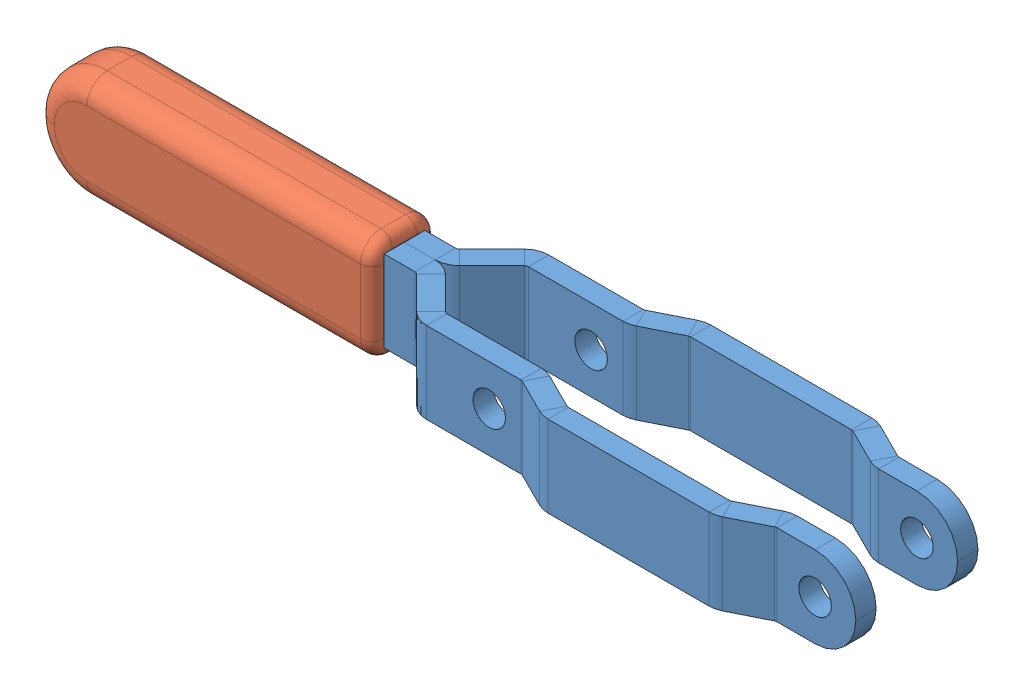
SolidWorks assembly handle sub-assy_&.sldasm, configuration Default (file format 3100). Lengths in mm.
Overall size (132.59 16.51 25.4).
3 component instances, 2 part files, 5 mates.
Components (placement in the parent):
- handle-half_&-1: handle-half_&.SLDPRT [Default] at (2.3468 22.924 12.7) size (130.68 12.7 12.7)
- handle-half_&-2: handle-half_&.SLDPRT [Default] at (2.3468 35.624 0) x (1 0 0) z (0 0 -1) size (130.68 12.7 12.7)
- Grip sleeve-1: Grip sleeve.sldprt [Default] at (-128.3362 22.924 3.175) size (52.77 16.51 10.16)
Mates (geometry in assembly coordinates):
- MateConcentric1: concentric anti-aligned: cylinder of handle-half_&-1; cylinder of handle-half_&-2
- MateCoincident2: coincident anti-aligned: plane of handle-half_&-1; plane of handle-half_&-2
- MateConcentric5: concentric anti-aligned: cylinder of handle-half_&-1; cylinder of handle-half_&-2
- MateCoincident3: coincident aligned: line of handle-half_&-1; line of Grip sleeve-1
- MateCoincident4: coincident aligned: line of handle-half_&-1; line of Grip sleeve-1
